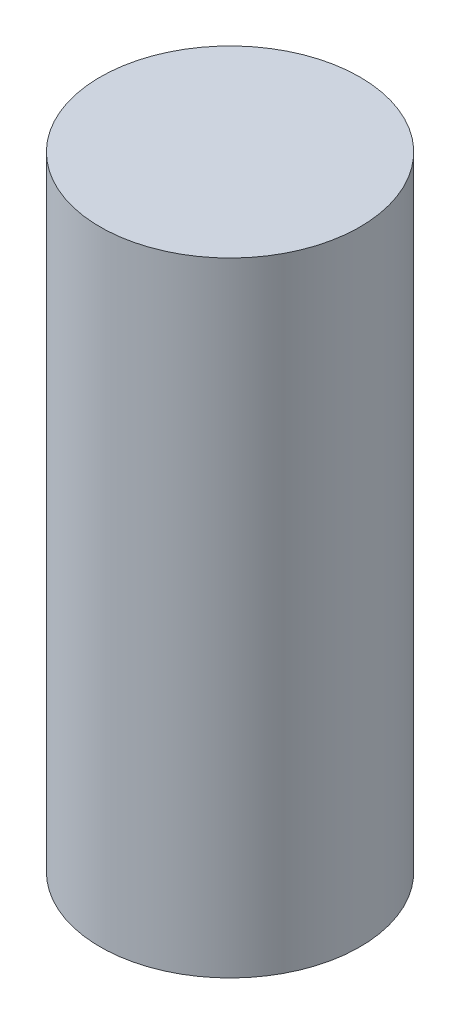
from build123d import *

# Parameters (mm, degrees)
SKETCH1_R   = 7.9375
BLOCK_DEPTH = 38.1


with BuildPart() as part:
    # Sketch1 → Block (new body)
    with BuildSketch(Plane(origin=(0, 0, 0), x_dir=(1, 0, 0), z_dir=(0, 1, 0))):
        with Locations(Location((0, 0, 0), (0, 0, 90))):
            Circle(SKETCH1_R)
    extrude(amount=BLOCK_DEPTH)


solid = part.part
